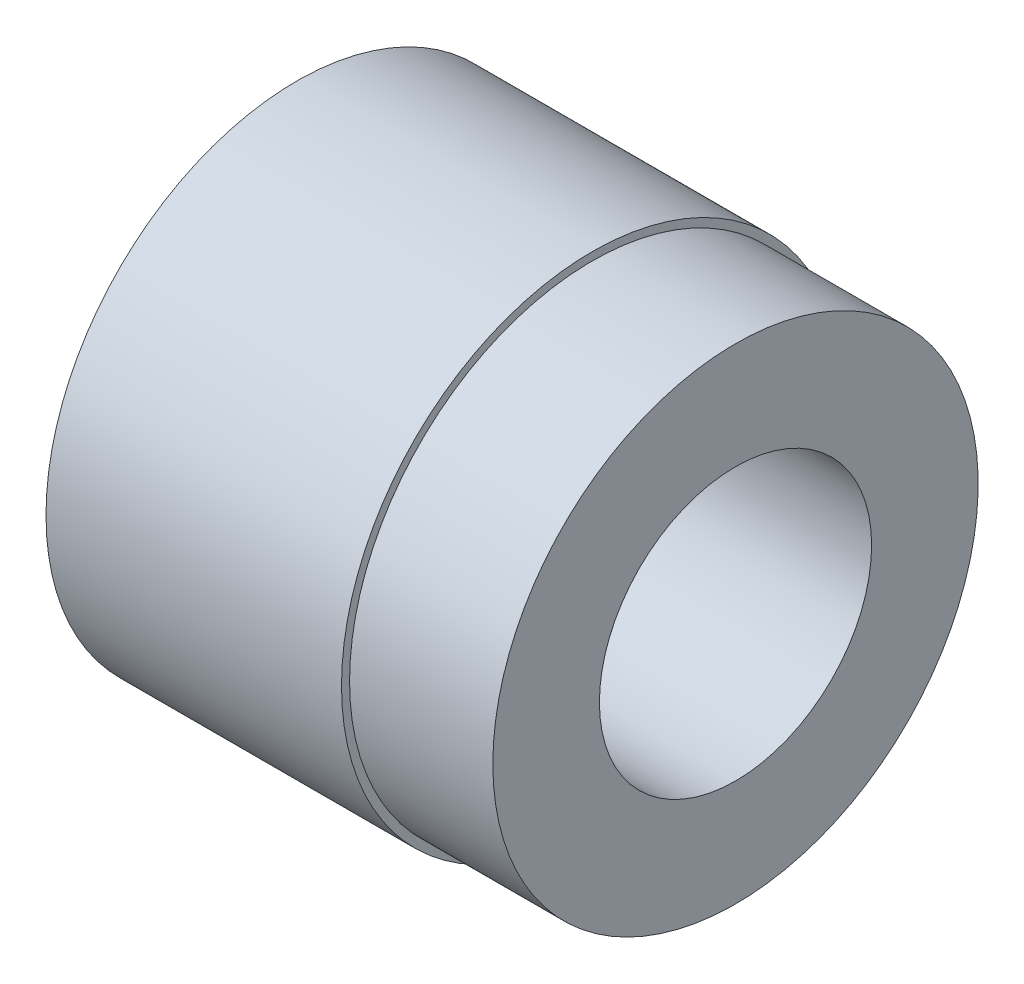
from build123d import *


with BuildPart() as part:
    # Esquisse1 → R_volution1 (revolve)
    with BuildSketch(Plane.XY, mode=Mode.PRIVATE) as r_volution1_sk:
        Polygon((43.604039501, 38), (43.604039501, 67.75), (3.604039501, 67.75), (3.604039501, 70), (-78.895960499, 70), (-78.895960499, 38), align=None)
    revolve(r_volution1_sk.sketch.rotate(Axis((-87.312401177, 0, 0), (1, 0, 0)), 90), axis=Axis((-87.312401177, 0, 0), (1, 0, 0)))


solid = part.part
